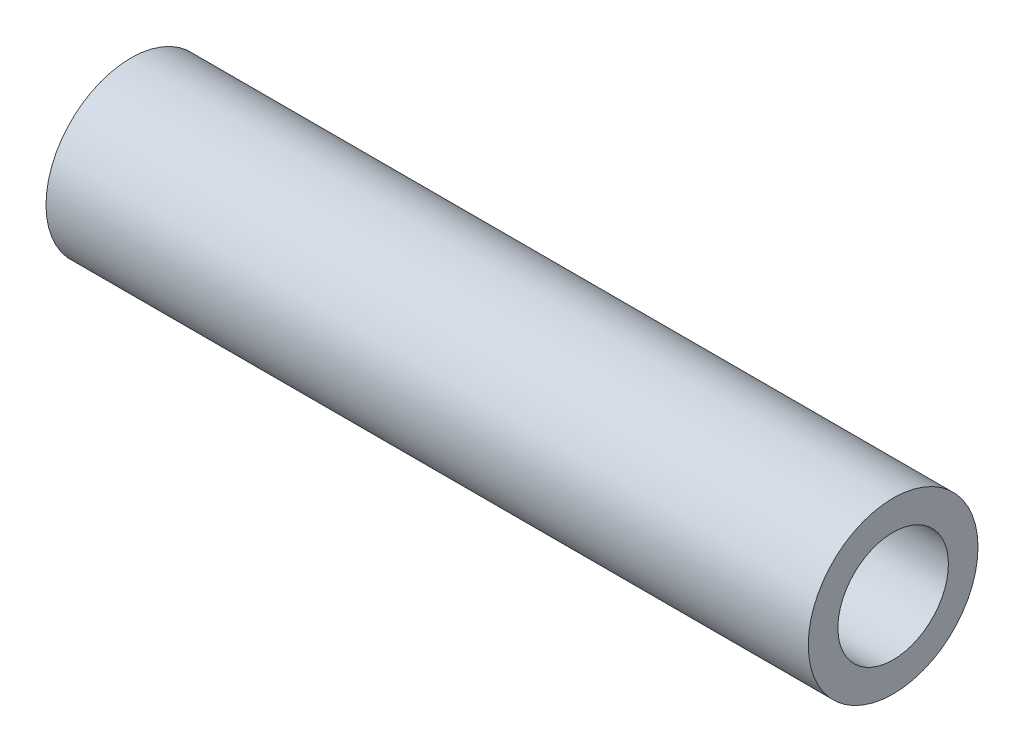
ISO-10303-21;
HEADER;
FILE_DESCRIPTION(('STEP AP214'),'2;1');
FILE_NAME('part.step','',(''),(''),'','','');
FILE_SCHEMA(('AUTOMOTIVE_DESIGN { 1 0 10303 214 1 1 1 1 }'));
ENDSEC;
DATA;
#1=APPLICATION_CONTEXT('core data for automotive mechanical design processes');
#2=APPLICATION_PROTOCOL_DEFINITION('international standard','automotive_design',2000,#1);
#3=PRODUCT_CONTEXT('',#1,'mechanical');
#4=PRODUCT('Part','Part','',(#3));
#5=PRODUCT_RELATED_PRODUCT_CATEGORY('part','',(#4));
#6=PRODUCT_DEFINITION_FORMATION('','',#4);
#7=PRODUCT_DEFINITION_CONTEXT('part definition',#1,'design');
#8=PRODUCT_DEFINITION('design','',#6,#7);
#9=PRODUCT_DEFINITION_SHAPE('','',#8);
#10=(LENGTH_UNIT() NAMED_UNIT(*) SI_UNIT(.MILLI.,.METRE.));
#11=(NAMED_UNIT(*) PLANE_ANGLE_UNIT() SI_UNIT($,.RADIAN.));
#12=(NAMED_UNIT(*) SI_UNIT($,.STERADIAN.) SOLID_ANGLE_UNIT());
#13=UNCERTAINTY_MEASURE_WITH_UNIT(LENGTH_MEASURE(1.E-05),#10,'distance_accuracy_value','');
#14=(GEOMETRIC_REPRESENTATION_CONTEXT(3) GLOBAL_UNCERTAINTY_ASSIGNED_CONTEXT((#13)) GLOBAL_UNIT_ASSIGNED_CONTEXT((#10,
#11,#12)) REPRESENTATION_CONTEXT('',''));
#15=CARTESIAN_POINT('',(0.,0.,0.));
#16=DIRECTION('',(0.,0.,1.));
#17=DIRECTION('',(1.,0.,0.));
#18=AXIS2_PLACEMENT_3D('',#15,#16,#17);
#19=CARTESIAN_POINT('',(-802.872223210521,-356.513239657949,-478.001852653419));
#20=DIRECTION('',(1.,0.,0.));
#21=DIRECTION('',(0.,0.,-1.));
#22=AXIS2_PLACEMENT_3D('',#19,#20,#21);
#23=CYLINDRICAL_SURFACE('',#22,5.52450000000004);
#24=CARTESIAN_POINT('',(-802.872223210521,-356.513239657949,-478.001852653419));
#25=DIRECTION('',(1.,0.,0.));
#26=DIRECTION('',(0.,0.,-1.));
#27=AXIS2_PLACEMENT_3D('',#24,#25,#26);
#28=CIRCLE('',#27,5.52450000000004);
#29=CARTESIAN_POINT('',(-802.872223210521,-356.513239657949,-483.526352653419));
#30=VERTEX_POINT('',#29);
#31=EDGE_CURVE('E18',#30,#30,#28,.T.);
#32=ORIENTED_EDGE('',*,*,#31,.F.);
#33=EDGE_LOOP('',(#32));
#34=FACE_BOUND('',#33,.T.);
#35=CARTESIAN_POINT('',(-726.672223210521,-356.513239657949,-478.001852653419));
#36=DIRECTION('',(1.,0.,0.));
#37=DIRECTION('',(0.,0.,-1.));
#38=AXIS2_PLACEMENT_3D('',#35,#36,#37);
#39=CIRCLE('',#38,5.52450000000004);
#40=CARTESIAN_POINT('',(-726.672223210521,-356.513239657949,-483.526352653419));
#41=VERTEX_POINT('',#40);
#42=EDGE_CURVE('E27',#41,#41,#39,.F.);
#43=ORIENTED_EDGE('',*,*,#42,.F.);
#44=EDGE_LOOP('',(#43));
#45=FACE_BOUND('',#44,.T.);
#46=ADVANCED_FACE('F15',(#34,#45),#23,.F.);
#47=CARTESIAN_POINT('',(-802.872223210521,-356.513239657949,-478.001852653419));
#48=DIRECTION('',(-1.,0.,0.));
#49=DIRECTION('',(0.,-1.,0.));
#50=AXIS2_PLACEMENT_3D('',#47,#48,#49);
#51=PLANE('',#50);
#52=ORIENTED_EDGE('',*,*,#31,.T.);
#53=EDGE_LOOP('',(#52));
#54=FACE_BOUND('',#53,.T.);
#55=CARTESIAN_POINT('',(-802.872223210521,-356.513239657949,-478.001852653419));
#56=DIRECTION('',(1.,0.,0.));
#57=DIRECTION('',(0.,0.,-1.));
#58=AXIS2_PLACEMENT_3D('',#55,#56,#57);
#59=CIRCLE('',#58,8.48360000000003);
#60=CARTESIAN_POINT('',(-802.872223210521,-356.513239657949,-486.485452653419));
#61=VERTEX_POINT('',#60);
#62=EDGE_CURVE('E22',#61,#61,#59,.T.);
#63=ORIENTED_EDGE('',*,*,#62,.F.);
#64=EDGE_LOOP('',(#63));
#65=FACE_BOUND('',#64,.T.);
#66=ADVANCED_FACE('F35',(#54,#65),#51,.T.);
#67=CARTESIAN_POINT('',(-726.672223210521,-356.513239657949,-478.001852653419));
#68=DIRECTION('',(1.,0.,0.));
#69=DIRECTION('',(0.,1.,0.));
#70=AXIS2_PLACEMENT_3D('',#67,#68,#69);
#71=PLANE('',#70);
#72=ORIENTED_EDGE('',*,*,#42,.T.);
#73=EDGE_LOOP('',(#72));
#74=FACE_BOUND('',#73,.T.);
#75=CARTESIAN_POINT('',(-726.672223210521,-356.513239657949,-478.001852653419));
#76=DIRECTION('',(1.,0.,0.));
#77=DIRECTION('',(0.,0.,-1.));
#78=AXIS2_PLACEMENT_3D('',#75,#76,#77);
#79=CIRCLE('',#78,8.48360000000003);
#80=CARTESIAN_POINT('',(-726.672223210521,-356.513239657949,-486.485452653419));
#81=VERTEX_POINT('',#80);
#82=EDGE_CURVE('E10',#81,#81,#79,.F.);
#83=ORIENTED_EDGE('',*,*,#82,.F.);
#84=EDGE_LOOP('',(#83));
#85=FACE_BOUND('',#84,.T.);
#86=ADVANCED_FACE('F44',(#74,#85),#71,.T.);
#87=CARTESIAN_POINT('',(-802.872223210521,-356.513239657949,-478.001852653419));
#88=DIRECTION('',(1.,0.,0.));
#89=DIRECTION('',(0.,0.,-1.));
#90=AXIS2_PLACEMENT_3D('',#87,#88,#89);
#91=CYLINDRICAL_SURFACE('',#90,8.48360000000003);
#92=ORIENTED_EDGE('',*,*,#82,.T.);
#93=EDGE_LOOP('',(#92));
#94=FACE_BOUND('',#93,.T.);
#95=ORIENTED_EDGE('',*,*,#62,.T.);
#96=EDGE_LOOP('',(#95));
#97=FACE_BOUND('',#96,.T.);
#98=ADVANCED_FACE('F45',(#94,#97),#91,.T.);
#99=CLOSED_SHELL('',(#46,#66,#86,#98));
#100=MANIFOLD_SOLID_BREP('B1',#99);
#101=ADVANCED_BREP_SHAPE_REPRESENTATION('',(#18,#100),#14);
#102=SHAPE_DEFINITION_REPRESENTATION(#9,#101);
ENDSEC;
END-ISO-10303-21;
